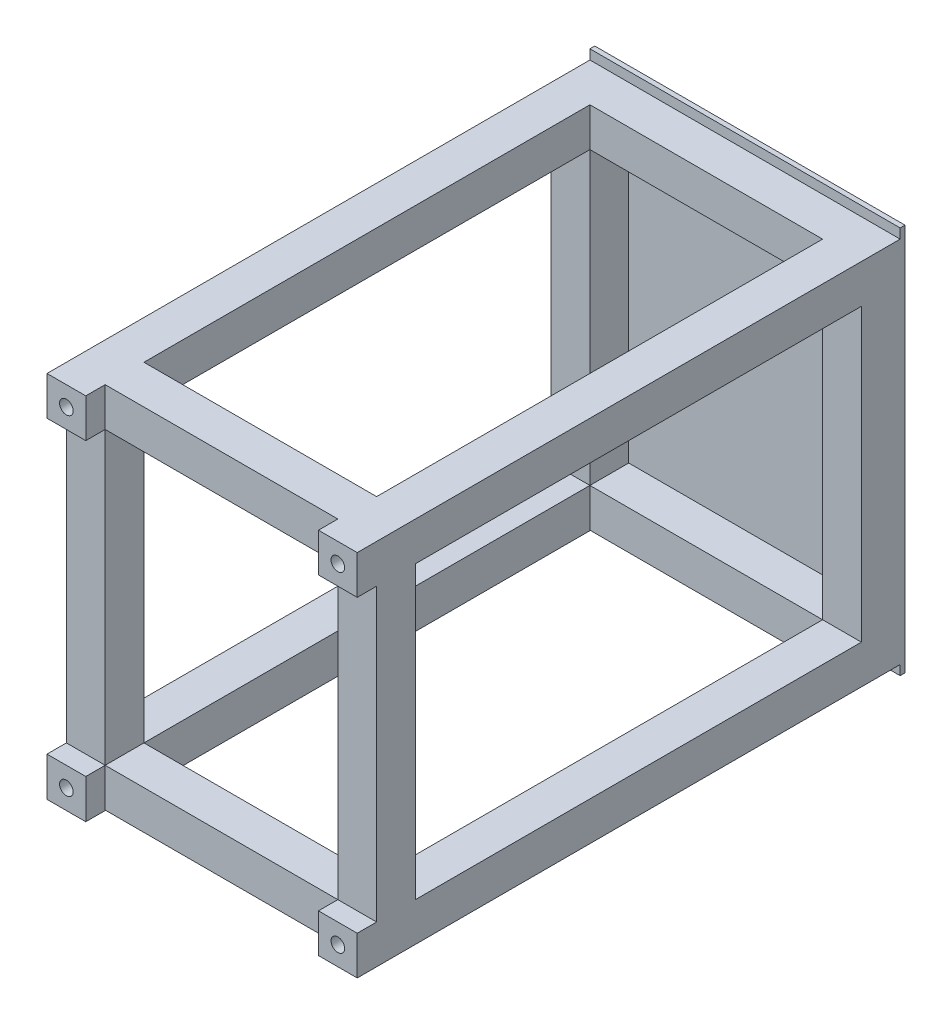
from build123d import *

# Parameters (mm, degrees)
SKETCH_1_W              = 320
SKETCH_1_H              = 400
EXTRUDE_1_DEPTH         = 5
SKETCH_2_W              = 240
SKETCH_2_H              = 40
EXTRUDE_2_DEPTH         = 40
SKETCH_3_W              = 40
SKETCH_3_H              = 380
SKETCH_3_H_2            = 380.450216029
EXTRUDE_3_DEPTH         = 40
SKETCH_4_W              = 40
SKETCH_4_H              = 40
SKETCH_4_H_2            = 40.450216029
EXTRUDE_4_DEPTH         = 520
PATTERN_LINEAR_1_COUNT  = 2
PATTERN_LINEAR_1_PITCH  = 500
HOLE_WIZARD_M16_1_D     = 14
HOLE_WIZARD_M16_1_DEPTH = 22
HOLE_WIZARD_M16_1_TIP   = 4.206024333


with BuildPart() as part:
    # Sketch 1 → Extrude 1 (new body)
    with BuildSketch(Plane.XY):
        Rectangle(SKETCH_1_W, SKETCH_1_H)
    extrude(amount=EXTRUDE_1_DEPTH)

    # Sketch 2 → Extrude 2 (add)
    with BuildSketch(Plane.XY.offset(5)):
        with Locations((0, 170)):
            Rectangle(SKETCH_2_W, SKETCH_2_H)
        with Locations((0, -170)):
            Rectangle(SKETCH_2_W, SKETCH_2_H)
    extrude_2 = extrude(amount=EXTRUDE_2_DEPTH)

    # Sketch 3 → Extrude 3 (add)
    with BuildSketch(Plane.XY.offset(5)):
        with Locations((140, 0)):
            Rectangle(SKETCH_3_W, SKETCH_3_H)
        with Locations((-140, -0.225108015)):
            Rectangle(SKETCH_3_W, SKETCH_3_H_2)
    extrude_3 = extrude(amount=EXTRUDE_3_DEPTH)

    # Sketch 4 → Extrude 4 (add)
    with BuildSketch(Plane.XY.offset(45)):
        with Locations((-140, 170)):
            Rectangle(SKETCH_4_W, SKETCH_4_H)
        with Locations((140, 170)):
            Rectangle(SKETCH_4_W, SKETCH_4_H)
        with Locations((140, -170)):
            Rectangle(SKETCH_4_W, SKETCH_4_H)
        with Locations((-140, -170.225108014)):
            Rectangle(SKETCH_4_W, SKETCH_4_H_2)
    extrude(amount=EXTRUDE_4_DEPTH)

    # Pattern Linear 1: Extrude 2, Extrude 3 ×2
    with Locations(*[(0, 0, i * PATTERN_LINEAR_1_PITCH) for i in range(1, PATTERN_LINEAR_1_COUNT)]):
        add(extrude_2)
        add(extrude_3)

    # Hole Wizard M16 _1
    with Locations(Plane.XY.offset(565)):
        with Locations((-140, 170), (140, 170), (-140, -170.225108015), (140, -170.225108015)):
            Hole(HOLE_WIZARD_M16_1_D / 2, depth=HOLE_WIZARD_M16_1_DEPTH)
            with Locations((0, 0, -(HOLE_WIZARD_M16_1_DEPTH + HOLE_WIZARD_M16_1_TIP / 2))):  # 118° drill point
                Cone(0, HOLE_WIZARD_M16_1_D / 2, HOLE_WIZARD_M16_1_TIP, mode=Mode.SUBTRACT)


solid = part.part
